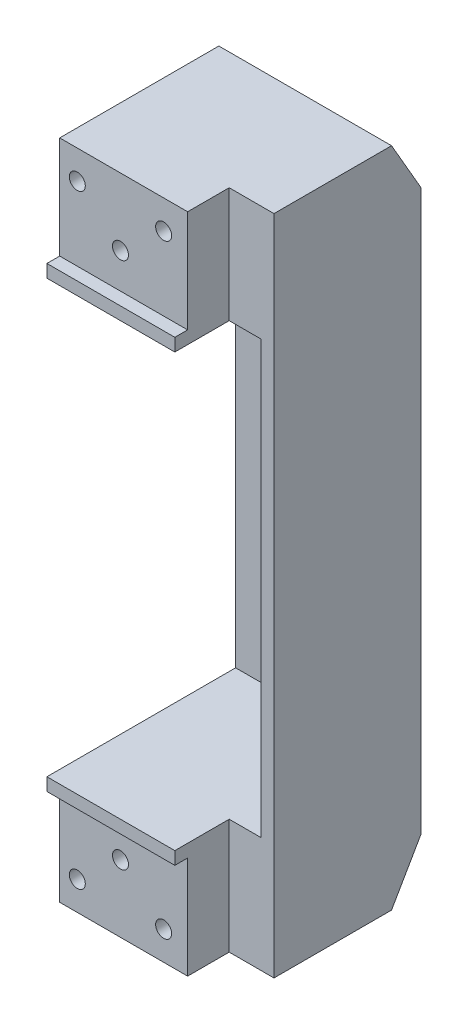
ISO-10303-21;
HEADER;
FILE_DESCRIPTION(('STEP AP214'),'2;1');
FILE_NAME('part.step','',(''),(''),'','','');
FILE_SCHEMA(('AUTOMOTIVE_DESIGN { 1 0 10303 214 1 1 1 1 }'));
ENDSEC;
DATA;
#1=APPLICATION_CONTEXT('core data for automotive mechanical design processes');
#2=APPLICATION_PROTOCOL_DEFINITION('international standard','automotive_design',2000,#1);
#3=PRODUCT_CONTEXT('',#1,'mechanical');
#4=PRODUCT('Part','Part','',(#3));
#5=PRODUCT_RELATED_PRODUCT_CATEGORY('part','',(#4));
#6=PRODUCT_DEFINITION_FORMATION('','',#4);
#7=PRODUCT_DEFINITION_CONTEXT('part definition',#1,'design');
#8=PRODUCT_DEFINITION('design','',#6,#7);
#9=PRODUCT_DEFINITION_SHAPE('','',#8);
#10=(LENGTH_UNIT() NAMED_UNIT(*) SI_UNIT(.MILLI.,.METRE.));
#11=(NAMED_UNIT(*) PLANE_ANGLE_UNIT() SI_UNIT($,.RADIAN.));
#12=(NAMED_UNIT(*) SI_UNIT($,.STERADIAN.) SOLID_ANGLE_UNIT());
#13=UNCERTAINTY_MEASURE_WITH_UNIT(LENGTH_MEASURE(1.E-05),#10,'distance_accuracy_value','');
#14=(GEOMETRIC_REPRESENTATION_CONTEXT(3) GLOBAL_UNCERTAINTY_ASSIGNED_CONTEXT((#13)) GLOBAL_UNIT_ASSIGNED_CONTEXT((#10,
#11,#12)) REPRESENTATION_CONTEXT('',''));
#15=CARTESIAN_POINT('',(0.,0.,0.));
#16=DIRECTION('',(0.,0.,1.));
#17=DIRECTION('',(1.,0.,0.));
#18=AXIS2_PLACEMENT_3D('',#15,#16,#17);
#19=CARTESIAN_POINT('',(0.,-175.,0.));
#20=DIRECTION('',(0.,1.,0.));
#21=DIRECTION('',(0.,0.,-1.));
#22=AXIS2_PLACEMENT_3D('',#19,#20,#21);
#23=PLANE('',#22);
#24=DIRECTION('',(-1.,0.,0.));
#25=VECTOR('',#24,1.);
#26=CARTESIAN_POINT('',(0.,-175.,0.));
#27=LINE('',#26,#25);
#28=CARTESIAN_POINT('',(40.,-175.,0.));
#29=VERTEX_POINT('',#28);
#30=CARTESIAN_POINT('',(0.,-175.,0.));
#31=VERTEX_POINT('',#30);
#32=EDGE_CURVE('E210',#29,#31,#27,.T.);
#33=ORIENTED_EDGE('',*,*,#32,.F.);
#34=DIRECTION('',(0.,0.,1.));
#35=VECTOR('',#34,1.);
#36=CARTESIAN_POINT('',(40.,-175.,-13.));
#37=LINE('',#36,#35);
#38=CARTESIAN_POINT('',(40.,-175.,4.));
#39=VERTEX_POINT('',#38);
#40=EDGE_CURVE('E236',#29,#39,#37,.T.);
#41=ORIENTED_EDGE('',*,*,#40,.T.);
#42=DIRECTION('',(-1.,0.,0.));
#43=VECTOR('',#42,1.);
#44=CARTESIAN_POINT('',(40.,-175.,4.));
#45=LINE('',#44,#43);
#46=CARTESIAN_POINT('',(0.,-175.,4.));
#47=VERTEX_POINT('',#46);
#48=EDGE_CURVE('E246',#39,#47,#45,.T.);
#49=ORIENTED_EDGE('',*,*,#48,.T.);
#50=DIRECTION('',(0.,0.,-1.));
#51=VECTOR('',#50,1.);
#52=CARTESIAN_POINT('',(0.,-175.,4.));
#53=LINE('',#52,#51);
#54=EDGE_CURVE('E231',#47,#31,#53,.T.);
#55=ORIENTED_EDGE('',*,*,#54,.T.);
#56=EDGE_LOOP('',(#33,#41,#49,#55));
#57=FACE_BOUND('',#56,.T.);
#58=ADVANCED_FACE('F42',(#57),#23,.F.);
#59=CARTESIAN_POINT('',(54.,-32.,-13.));
#60=DIRECTION('',(1.,0.,0.));
#61=DIRECTION('',(0.,0.,-1.));
#62=AXIS2_PLACEMENT_3D('',#59,#60,#61);
#63=PLANE('',#62);
#64=DIRECTION('',(0.,0.,1.));
#65=VECTOR('',#64,1.);
#66=CARTESIAN_POINT('',(54.,-207.,-59.));
#67=LINE('',#66,#65);
#68=CARTESIAN_POINT('',(54.,-207.,-49.762395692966));
#69=VERTEX_POINT('',#68);
#70=CARTESIAN_POINT('',(54.,-207.,-13.));
#71=VERTEX_POINT('',#70);
#72=EDGE_CURVE('E214',#69,#71,#67,.T.);
#73=ORIENTED_EDGE('',*,*,#72,.F.);
#74=DIRECTION('',(0.,-0.86602540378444,0.499999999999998));
#75=VECTOR('',#74,1.);
#76=CARTESIAN_POINT('',(54.,-91.6685842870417,-116.349019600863));
#77=LINE('',#76,#75);
#78=CARTESIAN_POINT('',(54.,-191.,-59.));
#79=VERTEX_POINT('',#78);
#80=EDGE_CURVE('E352',#69,#79,#77,.F.);
#81=ORIENTED_EDGE('',*,*,#80,.T.);
#82=DIRECTION('',(0.,1.,0.));
#83=VECTOR('',#82,1.);
#84=CARTESIAN_POINT('',(54.,-32.,-59.));
#85=LINE('',#84,#83);
#86=CARTESIAN_POINT('',(54.,-16.0000000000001,-59.));
#87=VERTEX_POINT('',#86);
#88=EDGE_CURVE('E320',#79,#87,#85,.T.);
#89=ORIENTED_EDGE('',*,*,#88,.T.);
#90=DIRECTION('',(0.,0.86602540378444,0.499999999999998));
#91=VECTOR('',#90,1.);
#92=CARTESIAN_POINT('',(54.,-8.08141571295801,-54.4282032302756));
#93=LINE('',#92,#91);
#94=CARTESIAN_POINT('',(54.,0.,-49.762395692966));
#95=VERTEX_POINT('',#94);
#96=EDGE_CURVE('E350',#87,#95,#93,.T.);
#97=ORIENTED_EDGE('',*,*,#96,.T.);
#98=DIRECTION('',(0.,0.,-1.));
#99=VECTOR('',#98,1.);
#100=CARTESIAN_POINT('',(54.,0.,-13.));
#101=LINE('',#100,#99);
#102=CARTESIAN_POINT('',(54.,0.,-13.));
#103=VERTEX_POINT('',#102);
#104=EDGE_CURVE('E316',#103,#95,#101,.T.);
#105=ORIENTED_EDGE('',*,*,#104,.F.);
#106=DIRECTION('',(0.,1.,0.));
#107=VECTOR('',#106,1.);
#108=CARTESIAN_POINT('',(54.,-32.,-13.));
#109=LINE('',#108,#107);
#110=EDGE_CURVE('E334',#71,#103,#109,.T.);
#111=ORIENTED_EDGE('',*,*,#110,.F.);
#112=EDGE_LOOP('',(#73,#81,#89,#97,#105,#111));
#113=FACE_BOUND('',#112,.T.);
#114=ADVANCED_FACE('F372',(#113),#63,.T.);
#115=CARTESIAN_POINT('',(54.,-32.,-13.));
#116=DIRECTION('',(0.,0.,1.));
#117=DIRECTION('',(1.,0.,0.));
#118=AXIS2_PLACEMENT_3D('',#115,#116,#117);
#119=PLANE('',#118);
#120=DIRECTION('',(1.,0.,0.));
#121=VECTOR('',#120,1.);
#122=CARTESIAN_POINT('',(54.,0.,-13.));
#123=LINE('',#122,#121);
#124=CARTESIAN_POINT('',(40.,0.,-13.));
#125=VERTEX_POINT('',#124);
#126=EDGE_CURVE('E321',#125,#103,#123,.T.);
#127=ORIENTED_EDGE('',*,*,#126,.F.);
#128=DIRECTION('',(0.,1.,0.));
#129=VECTOR('',#128,1.);
#130=CARTESIAN_POINT('',(40.,-32.,-13.));
#131=LINE('',#130,#129);
#132=CARTESIAN_POINT('',(40.,-36.,-13.));
#133=VERTEX_POINT('',#132);
#134=EDGE_CURVE('E337',#133,#125,#131,.T.);
#135=ORIENTED_EDGE('',*,*,#134,.F.);
#136=DIRECTION('',(-1.,0.,0.));
#137=VECTOR('',#136,1.);
#138=CARTESIAN_POINT('',(54.,-36.,-13.));
#139=LINE('',#138,#137);
#140=CARTESIAN_POINT('',(50.,-36.,-13.));
#141=VERTEX_POINT('',#140);
#142=EDGE_CURVE('E296',#141,#133,#139,.T.);
#143=ORIENTED_EDGE('',*,*,#142,.F.);
#144=DIRECTION('',(0.,1.,0.));
#145=VECTOR('',#144,1.);
#146=CARTESIAN_POINT('',(50.,-171.,-13.));
#147=LINE('',#146,#145);
#148=CARTESIAN_POINT('',(50.,-171.,-13.));
#149=VERTEX_POINT('',#148);
#150=EDGE_CURVE('E292',#149,#141,#147,.T.);
#151=ORIENTED_EDGE('',*,*,#150,.F.);
#152=DIRECTION('',(-1.,0.,0.));
#153=VECTOR('',#152,1.);
#154=CARTESIAN_POINT('',(54.,-171.,-13.));
#155=LINE('',#154,#153);
#156=CARTESIAN_POINT('',(40.,-171.,-13.));
#157=VERTEX_POINT('',#156);
#158=EDGE_CURVE('E242',#149,#157,#155,.T.);
#159=ORIENTED_EDGE('',*,*,#158,.T.);
#160=DIRECTION('',(0.,-1.,0.));
#161=VECTOR('',#160,1.);
#162=CARTESIAN_POINT('',(40.,-171.,-13.));
#163=LINE('',#162,#161);
#164=CARTESIAN_POINT('',(40.,-207.,-13.));
#165=VERTEX_POINT('',#164);
#166=EDGE_CURVE('E244',#157,#165,#163,.T.);
#167=ORIENTED_EDGE('',*,*,#166,.T.);
#168=DIRECTION('',(-1.,0.,0.));
#169=VECTOR('',#168,1.);
#170=CARTESIAN_POINT('',(54.,-207.,-13.));
#171=LINE('',#170,#169);
#172=EDGE_CURVE('E216',#71,#165,#171,.T.);
#173=ORIENTED_EDGE('',*,*,#172,.F.);
#174=ORIENTED_EDGE('',*,*,#110,.T.);
#175=EDGE_LOOP('',(#127,#135,#143,#151,#159,#167,#173,#174));
#176=FACE_BOUND('',#175,.T.);
#177=ADVANCED_FACE('F384',(#176),#119,.T.);
#178=CARTESIAN_POINT('',(40.,-32.,-13.));
#179=DIRECTION('',(1.,0.,0.));
#180=DIRECTION('',(0.,0.,-1.));
#181=AXIS2_PLACEMENT_3D('',#178,#179,#180);
#182=PLANE('',#181);
#183=DIRECTION('',(0.,0.,-1.));
#184=VECTOR('',#183,1.);
#185=CARTESIAN_POINT('',(40.,0.,-13.));
#186=LINE('',#185,#184);
#187=CARTESIAN_POINT('',(40.,0.,0.));
#188=VERTEX_POINT('',#187);
#189=EDGE_CURVE('E329',#188,#125,#186,.T.);
#190=ORIENTED_EDGE('',*,*,#189,.F.);
#191=DIRECTION('',(0.,1.,0.));
#192=VECTOR('',#191,1.);
#193=CARTESIAN_POINT('',(40.,-32.,0.));
#194=LINE('',#193,#192);
#195=CARTESIAN_POINT('',(40.,-32.,0.));
#196=VERTEX_POINT('',#195);
#197=EDGE_CURVE('E339',#196,#188,#194,.T.);
#198=ORIENTED_EDGE('',*,*,#197,.F.);
#199=DIRECTION('',(0.,0.,1.));
#200=VECTOR('',#199,1.);
#201=CARTESIAN_POINT('',(40.,-32.,-13.));
#202=LINE('',#201,#200);
#203=CARTESIAN_POINT('',(40.,-32.,4.));
#204=VERTEX_POINT('',#203);
#205=EDGE_CURVE('E295',#196,#204,#202,.T.);
#206=ORIENTED_EDGE('',*,*,#205,.T.);
#207=DIRECTION('',(0.,1.,0.));
#208=VECTOR('',#207,1.);
#209=CARTESIAN_POINT('',(40.,-36.,4.));
#210=LINE('',#209,#208);
#211=CARTESIAN_POINT('',(40.,-36.,4.));
#212=VERTEX_POINT('',#211);
#213=EDGE_CURVE('E313',#212,#204,#210,.T.);
#214=ORIENTED_EDGE('',*,*,#213,.F.);
#215=DIRECTION('',(0.,0.,1.));
#216=VECTOR('',#215,1.);
#217=CARTESIAN_POINT('',(40.,-36.,-13.));
#218=LINE('',#217,#216);
#219=EDGE_CURVE('E298',#133,#212,#218,.T.);
#220=ORIENTED_EDGE('',*,*,#219,.F.);
#221=ORIENTED_EDGE('',*,*,#134,.T.);
#222=EDGE_LOOP('',(#190,#198,#206,#214,#220,#221));
#223=FACE_BOUND('',#222,.T.);
#224=ADVANCED_FACE('F420',(#223),#182,.T.);
#225=CARTESIAN_POINT('',(0.,-32.,0.));
#226=DIRECTION('',(0.,0.,1.));
#227=DIRECTION('',(1.,0.,0.));
#228=AXIS2_PLACEMENT_3D('',#225,#226,#227);
#229=PLANE('',#228);
#230=CARTESIAN_POINT('',(5.5,-9.,0.));
#231=DIRECTION('',(0.,0.,1.));
#232=DIRECTION('',(1.,0.,0.));
#233=AXIS2_PLACEMENT_3D('',#230,#231,#232);
#234=CIRCLE('',#233,2.5);
#235=CARTESIAN_POINT('',(8.,-9.,0.));
#236=VERTEX_POINT('',#235);
#237=EDGE_CURVE('E256',#236,#236,#234,.T.);
#238=ORIENTED_EDGE('',*,*,#237,.F.);
#239=EDGE_LOOP('',(#238));
#240=FACE_BOUND('',#239,.T.);
#241=CARTESIAN_POINT('',(32.5,-9.,0.));
#242=DIRECTION('',(0.,0.,1.));
#243=DIRECTION('',(1.,0.,0.));
#244=AXIS2_PLACEMENT_3D('',#241,#242,#243);
#245=CIRCLE('',#244,2.5);
#246=CARTESIAN_POINT('',(35.,-9.,0.));
#247=VERTEX_POINT('',#246);
#248=EDGE_CURVE('E262',#247,#247,#245,.T.);
#249=ORIENTED_EDGE('',*,*,#248,.F.);
#250=EDGE_LOOP('',(#249));
#251=FACE_BOUND('',#250,.T.);
#252=CARTESIAN_POINT('',(19.,-21.,0.));
#253=DIRECTION('',(0.,0.,1.));
#254=DIRECTION('',(1.,0.,0.));
#255=AXIS2_PLACEMENT_3D('',#252,#253,#254);
#256=CIRCLE('',#255,2.5);
#257=CARTESIAN_POINT('',(21.5,-21.,0.));
#258=VERTEX_POINT('',#257);
#259=EDGE_CURVE('E268',#258,#258,#256,.T.);
#260=ORIENTED_EDGE('',*,*,#259,.F.);
#261=EDGE_LOOP('',(#260));
#262=FACE_BOUND('',#261,.T.);
#263=DIRECTION('',(1.,0.,0.));
#264=VECTOR('',#263,1.);
#265=CARTESIAN_POINT('',(0.,0.,0.));
#266=LINE('',#265,#264);
#267=CARTESIAN_POINT('',(0.,0.,0.));
#268=VERTEX_POINT('',#267);
#269=EDGE_CURVE('E326',#268,#188,#266,.T.);
#270=ORIENTED_EDGE('',*,*,#269,.F.);
#271=DIRECTION('',(0.,1.,0.));
#272=VECTOR('',#271,1.);
#273=CARTESIAN_POINT('',(0.,-32.,0.));
#274=LINE('',#273,#272);
#275=CARTESIAN_POINT('',(0.,-32.,0.));
#276=VERTEX_POINT('',#275);
#277=EDGE_CURVE('E341',#276,#268,#274,.T.);
#278=ORIENTED_EDGE('',*,*,#277,.F.);
#279=DIRECTION('',(1.,0.,0.));
#280=VECTOR('',#279,1.);
#281=CARTESIAN_POINT('',(0.,-32.,0.));
#282=LINE('',#281,#280);
#283=EDGE_CURVE('E317',#276,#196,#282,.T.);
#284=ORIENTED_EDGE('',*,*,#283,.T.);
#285=ORIENTED_EDGE('',*,*,#197,.T.);
#286=EDGE_LOOP('',(#270,#278,#284,#285));
#287=FACE_BOUND('',#286,.T.);
#288=ADVANCED_FACE('F431',(#240,#251,#262,#287),#229,.T.);
#289=CARTESIAN_POINT('',(0.,-32.,0.));
#290=DIRECTION('',(-1.,0.,0.));
#291=DIRECTION('',(0.,0.,1.));
#292=AXIS2_PLACEMENT_3D('',#289,#290,#291);
#293=PLANE('',#292);
#294=DIRECTION('',(0.,1.,0.));
#295=VECTOR('',#294,1.);
#296=CARTESIAN_POINT('',(0.,-32.,-59.));
#297=LINE('',#296,#295);
#298=CARTESIAN_POINT('',(0.,-191.,-59.));
#299=VERTEX_POINT('',#298);
#300=CARTESIAN_POINT('',(0.,-16.0000000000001,-59.));
#301=VERTEX_POINT('',#300);
#302=EDGE_CURVE('E344',#299,#301,#297,.T.);
#303=ORIENTED_EDGE('',*,*,#302,.F.);
#304=DIRECTION('',(0.,0.86602540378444,-0.499999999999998));
#305=VECTOR('',#304,1.);
#306=CARTESIAN_POINT('',(0.,-97.2977494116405,-113.099019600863));
#307=LINE('',#306,#305);
#308=CARTESIAN_POINT('',(0.,-207.,-49.762395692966));
#309=VERTEX_POINT('',#308);
#310=EDGE_CURVE('E50',#299,#309,#307,.F.);
#311=ORIENTED_EDGE('',*,*,#310,.T.);
#312=DIRECTION('',(0.,0.,-1.));
#313=VECTOR('',#312,1.);
#314=CARTESIAN_POINT('',(0.,-207.,0.));
#315=LINE('',#314,#313);
#316=CARTESIAN_POINT('',(0.,-207.,0.));
#317=VERTEX_POINT('',#316);
#318=EDGE_CURVE('E211',#317,#309,#315,.T.);
#319=ORIENTED_EDGE('',*,*,#318,.F.);
#320=DIRECTION('',(0.,1.,0.));
#321=VECTOR('',#320,1.);
#322=CARTESIAN_POINT('',(0.,-207.,0.));
#323=LINE('',#322,#321);
#324=EDGE_CURVE('E223',#317,#31,#323,.T.);
#325=ORIENTED_EDGE('',*,*,#324,.T.);
#326=ORIENTED_EDGE('',*,*,#54,.F.);
#327=DIRECTION('',(0.,-1.,0.));
#328=VECTOR('',#327,1.);
#329=CARTESIAN_POINT('',(0.,-171.,4.));
#330=LINE('',#329,#328);
#331=CARTESIAN_POINT('',(0.,-171.,4.));
#332=VERTEX_POINT('',#331);
#333=EDGE_CURVE('E254',#332,#47,#330,.T.);
#334=ORIENTED_EDGE('',*,*,#333,.F.);
#335=DIRECTION('',(0.,0.,-1.));
#336=VECTOR('',#335,1.);
#337=CARTESIAN_POINT('',(0.,-171.,4.));
#338=LINE('',#337,#336);
#339=CARTESIAN_POINT('',(0.,-171.,-55.));
#340=VERTEX_POINT('',#339);
#341=EDGE_CURVE('E232',#332,#340,#338,.T.);
#342=ORIENTED_EDGE('',*,*,#341,.T.);
#343=DIRECTION('',(0.,1.,0.));
#344=VECTOR('',#343,1.);
#345=CARTESIAN_POINT('',(0.,-171.,-55.));
#346=LINE('',#345,#344);
#347=CARTESIAN_POINT('',(0.,-36.,-55.));
#348=VERTEX_POINT('',#347);
#349=EDGE_CURVE('E282',#340,#348,#346,.T.);
#350=ORIENTED_EDGE('',*,*,#349,.T.);
#351=DIRECTION('',(0.,0.,-1.));
#352=VECTOR('',#351,1.);
#353=CARTESIAN_POINT('',(0.,-36.,4.));
#354=LINE('',#353,#352);
#355=CARTESIAN_POINT('',(0.,-36.,4.));
#356=VERTEX_POINT('',#355);
#357=EDGE_CURVE('E303',#356,#348,#354,.T.);
#358=ORIENTED_EDGE('',*,*,#357,.F.);
#359=DIRECTION('',(0.,1.,0.));
#360=VECTOR('',#359,1.);
#361=CARTESIAN_POINT('',(0.,-36.,4.));
#362=LINE('',#361,#360);
#363=CARTESIAN_POINT('',(0.,-32.,4.));
#364=VERTEX_POINT('',#363);
#365=EDGE_CURVE('E305',#356,#364,#362,.T.);
#366=ORIENTED_EDGE('',*,*,#365,.T.);
#367=DIRECTION('',(0.,0.,-1.));
#368=VECTOR('',#367,1.);
#369=CARTESIAN_POINT('',(0.,-32.,4.));
#370=LINE('',#369,#368);
#371=EDGE_CURVE('E299',#364,#276,#370,.T.);
#372=ORIENTED_EDGE('',*,*,#371,.T.);
#373=ORIENTED_EDGE('',*,*,#277,.T.);
#374=DIRECTION('',(0.,0.,1.));
#375=VECTOR('',#374,1.);
#376=CARTESIAN_POINT('',(0.,0.,0.));
#377=LINE('',#376,#375);
#378=CARTESIAN_POINT('',(0.,0.,-49.762395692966));
#379=VERTEX_POINT('',#378);
#380=EDGE_CURVE('E324',#379,#268,#377,.T.);
#381=ORIENTED_EDGE('',*,*,#380,.F.);
#382=DIRECTION('',(0.,-0.86602540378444,-0.499999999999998));
#383=VECTOR('',#382,1.);
#384=CARTESIAN_POINT('',(0.,-2.45225058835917,-51.1782032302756));
#385=LINE('',#384,#383);
#386=EDGE_CURVE('E57',#379,#301,#385,.T.);
#387=ORIENTED_EDGE('',*,*,#386,.T.);
#388=EDGE_LOOP('',(#303,#311,#319,#325,#326,#334,#342,#350,#358,#366,#372,#373,#381,#387));
#389=FACE_BOUND('',#388,.T.);
#390=ADVANCED_FACE('F360',(#389),#293,.T.);
#391=CARTESIAN_POINT('',(0.,-32.,-59.));
#392=DIRECTION('',(0.,0.,-1.));
#393=DIRECTION('',(-1.,0.,0.));
#394=AXIS2_PLACEMENT_3D('',#391,#392,#393);
#395=PLANE('',#394);
#396=ORIENTED_EDGE('',*,*,#88,.F.);
#397=DIRECTION('',(-1.,0.,0.));
#398=VECTOR('',#397,1.);
#399=CARTESIAN_POINT('',(0.,-191.,-59.));
#400=LINE('',#399,#398);
#401=EDGE_CURVE('E356',#79,#299,#400,.T.);
#402=ORIENTED_EDGE('',*,*,#401,.T.);
#403=ORIENTED_EDGE('',*,*,#302,.T.);
#404=DIRECTION('',(1.,0.,0.));
#405=VECTOR('',#404,1.);
#406=CARTESIAN_POINT('',(54.,-16.0000000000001,-59.));
#407=LINE('',#406,#405);
#408=EDGE_CURVE('E354',#301,#87,#407,.T.);
#409=ORIENTED_EDGE('',*,*,#408,.T.);
#410=EDGE_LOOP('',(#396,#402,#403,#409));
#411=FACE_BOUND('',#410,.T.);
#412=ADVANCED_FACE('F376',(#411),#395,.T.);
#413=CARTESIAN_POINT('',(0.,0.,0.));
#414=DIRECTION('',(0.,-1.,0.));
#415=DIRECTION('',(0.,0.,-1.));
#416=AXIS2_PLACEMENT_3D('',#413,#414,#415);
#417=PLANE('',#416);
#418=ORIENTED_EDGE('',*,*,#104,.T.);
#419=DIRECTION('',(-1.,0.,0.));
#420=VECTOR('',#419,1.);
#421=CARTESIAN_POINT('',(0.,0.,-49.762395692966));
#422=LINE('',#421,#420);
#423=EDGE_CURVE('E11',#95,#379,#422,.T.);
#424=ORIENTED_EDGE('',*,*,#423,.T.);
#425=ORIENTED_EDGE('',*,*,#380,.T.);
#426=ORIENTED_EDGE('',*,*,#269,.T.);
#427=ORIENTED_EDGE('',*,*,#189,.T.);
#428=ORIENTED_EDGE('',*,*,#126,.T.);
#429=EDGE_LOOP('',(#418,#424,#425,#426,#427,#428));
#430=FACE_BOUND('',#429,.T.);
#431=ADVANCED_FACE('F379',(#430),#417,.F.);
#432=CARTESIAN_POINT('',(40.,-36.,4.));
#433=DIRECTION('',(0.,0.,-1.));
#434=DIRECTION('',(-1.,0.,0.));
#435=AXIS2_PLACEMENT_3D('',#432,#433,#434);
#436=PLANE('',#435);
#437=DIRECTION('',(-1.,0.,0.));
#438=VECTOR('',#437,1.);
#439=CARTESIAN_POINT('',(40.,-32.,4.));
#440=LINE('',#439,#438);
#441=EDGE_CURVE('E307',#204,#364,#440,.T.);
#442=ORIENTED_EDGE('',*,*,#441,.T.);
#443=ORIENTED_EDGE('',*,*,#365,.F.);
#444=DIRECTION('',(-1.,0.,0.));
#445=VECTOR('',#444,1.);
#446=CARTESIAN_POINT('',(40.,-36.,4.));
#447=LINE('',#446,#445);
#448=EDGE_CURVE('E301',#212,#356,#447,.T.);
#449=ORIENTED_EDGE('',*,*,#448,.F.);
#450=ORIENTED_EDGE('',*,*,#213,.T.);
#451=EDGE_LOOP('',(#442,#443,#449,#450));
#452=FACE_BOUND('',#451,.T.);
#453=ADVANCED_FACE('F424',(#452),#436,.F.);
#454=CARTESIAN_POINT('',(0.,-36.,0.));
#455=DIRECTION('',(0.,-1.,0.));
#456=DIRECTION('',(0.,0.,-1.));
#457=AXIS2_PLACEMENT_3D('',#454,#455,#456);
#458=PLANE('',#457);
#459=DIRECTION('',(-1.,0.,0.));
#460=VECTOR('',#459,1.);
#461=CARTESIAN_POINT('',(0.,-36.,-55.));
#462=LINE('',#461,#460);
#463=CARTESIAN_POINT('',(50.,-36.,-55.));
#464=VERTEX_POINT('',#463);
#465=EDGE_CURVE('E279',#464,#348,#462,.T.);
#466=ORIENTED_EDGE('',*,*,#465,.F.);
#467=DIRECTION('',(0.,0.,-1.));
#468=VECTOR('',#467,1.);
#469=CARTESIAN_POINT('',(50.,-36.,-13.));
#470=LINE('',#469,#468);
#471=EDGE_CURVE('E274',#141,#464,#470,.T.);
#472=ORIENTED_EDGE('',*,*,#471,.F.);
#473=ORIENTED_EDGE('',*,*,#142,.T.);
#474=ORIENTED_EDGE('',*,*,#219,.T.);
#475=ORIENTED_EDGE('',*,*,#448,.T.);
#476=ORIENTED_EDGE('',*,*,#357,.T.);
#477=EDGE_LOOP('',(#466,#472,#473,#474,#475,#476));
#478=FACE_BOUND('',#477,.T.);
#479=ADVANCED_FACE('F412',(#478),#458,.T.);
#480=CARTESIAN_POINT('',(0.,-32.,0.));
#481=DIRECTION('',(0.,-1.,0.));
#482=DIRECTION('',(0.,0.,-1.));
#483=AXIS2_PLACEMENT_3D('',#480,#481,#482);
#484=PLANE('',#483);
#485=ORIENTED_EDGE('',*,*,#283,.F.);
#486=ORIENTED_EDGE('',*,*,#371,.F.);
#487=ORIENTED_EDGE('',*,*,#441,.F.);
#488=ORIENTED_EDGE('',*,*,#205,.F.);
#489=EDGE_LOOP('',(#485,#486,#487,#488));
#490=FACE_BOUND('',#489,.T.);
#491=ADVANCED_FACE('F428',(#490),#484,.F.);
#492=CARTESIAN_POINT('',(50.,-171.,-13.));
#493=DIRECTION('',(1.,0.,0.));
#494=DIRECTION('',(0.,0.,-1.));
#495=AXIS2_PLACEMENT_3D('',#492,#493,#494);
#496=PLANE('',#495);
#497=ORIENTED_EDGE('',*,*,#471,.T.);
#498=DIRECTION('',(0.,1.,0.));
#499=VECTOR('',#498,1.);
#500=CARTESIAN_POINT('',(50.,-171.,-55.));
#501=LINE('',#500,#499);
#502=CARTESIAN_POINT('',(50.,-171.,-55.));
#503=VERTEX_POINT('',#502);
#504=EDGE_CURVE('E289',#503,#464,#501,.T.);
#505=ORIENTED_EDGE('',*,*,#504,.F.);
#506=DIRECTION('',(0.,0.,-1.));
#507=VECTOR('',#506,1.);
#508=CARTESIAN_POINT('',(50.,-171.,-13.));
#509=LINE('',#508,#507);
#510=EDGE_CURVE('E275',#149,#503,#509,.T.);
#511=ORIENTED_EDGE('',*,*,#510,.F.);
#512=ORIENTED_EDGE('',*,*,#150,.T.);
#513=EDGE_LOOP('',(#497,#505,#511,#512));
#514=FACE_BOUND('',#513,.T.);
#515=ADVANCED_FACE('F414',(#514),#496,.F.);
#516=CARTESIAN_POINT('',(0.,-171.,-55.));
#517=DIRECTION('',(0.,0.,-1.));
#518=DIRECTION('',(-1.,0.,0.));
#519=AXIS2_PLACEMENT_3D('',#516,#517,#518);
#520=PLANE('',#519);
#521=ORIENTED_EDGE('',*,*,#465,.T.);
#522=ORIENTED_EDGE('',*,*,#349,.F.);
#523=DIRECTION('',(-1.,0.,0.));
#524=VECTOR('',#523,1.);
#525=CARTESIAN_POINT('',(0.,-171.,-55.));
#526=LINE('',#525,#524);
#527=EDGE_CURVE('E278',#503,#340,#526,.T.);
#528=ORIENTED_EDGE('',*,*,#527,.F.);
#529=ORIENTED_EDGE('',*,*,#504,.T.);
#530=EDGE_LOOP('',(#521,#522,#528,#529));
#531=FACE_BOUND('',#530,.T.);
#532=ADVANCED_FACE('F410',(#531),#520,.F.);
#533=CARTESIAN_POINT('',(19.,-21.,-18.));
#534=DIRECTION('',(0.,0.,1.));
#535=DIRECTION('',(1.,0.,0.));
#536=AXIS2_PLACEMENT_3D('',#533,#534,#535);
#537=CONICAL_SURFACE('',#536,2.5,1.02974425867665);
#538=CARTESIAN_POINT('',(19.,-21.,-19.5021515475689));
#539=VERTEX_POINT('',#538);
#540=VERTEX_LOOP('',#539);
#541=FACE_BOUND('',#540,.T.);
#542=CARTESIAN_POINT('',(19.,-21.,-18.));
#543=DIRECTION('',(0.,0.,1.));
#544=DIRECTION('',(1.,0.,0.));
#545=AXIS2_PLACEMENT_3D('',#542,#543,#544);
#546=CIRCLE('',#545,2.5);
#547=CARTESIAN_POINT('',(21.5,-21.,-18.));
#548=VERTEX_POINT('',#547);
#549=EDGE_CURVE('E271',#548,#548,#546,.T.);
#550=ORIENTED_EDGE('',*,*,#549,.T.);
#551=EDGE_LOOP('',(#550));
#552=FACE_BOUND('',#551,.T.);
#553=ADVANCED_FACE('F475',(#541,#552),#537,.F.);
#554=CARTESIAN_POINT('',(19.,-21.,0.));
#555=DIRECTION('',(0.,0.,1.));
#556=DIRECTION('',(1.,0.,0.));
#557=AXIS2_PLACEMENT_3D('',#554,#555,#556);
#558=CYLINDRICAL_SURFACE('',#557,2.5);
#559=ORIENTED_EDGE('',*,*,#549,.F.);
#560=EDGE_LOOP('',(#559));
#561=FACE_BOUND('',#560,.T.);
#562=ORIENTED_EDGE('',*,*,#259,.T.);
#563=EDGE_LOOP('',(#562));
#564=FACE_BOUND('',#563,.T.);
#565=ADVANCED_FACE('F471',(#561,#564),#558,.F.);
#566=CARTESIAN_POINT('',(32.5,-9.,-18.));
#567=DIRECTION('',(0.,0.,1.));
#568=DIRECTION('',(1.,0.,0.));
#569=AXIS2_PLACEMENT_3D('',#566,#567,#568);
#570=CONICAL_SURFACE('',#569,2.5,1.02974425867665);
#571=CARTESIAN_POINT('',(32.5,-9.,-19.5021515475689));
#572=VERTEX_POINT('',#571);
#573=VERTEX_LOOP('',#572);
#574=FACE_BOUND('',#573,.T.);
#575=CARTESIAN_POINT('',(32.5,-9.,-18.));
#576=DIRECTION('',(0.,0.,1.));
#577=DIRECTION('',(1.,0.,0.));
#578=AXIS2_PLACEMENT_3D('',#575,#576,#577);
#579=CIRCLE('',#578,2.5);
#580=CARTESIAN_POINT('',(35.,-9.,-18.));
#581=VERTEX_POINT('',#580);
#582=EDGE_CURVE('E265',#581,#581,#579,.T.);
#583=ORIENTED_EDGE('',*,*,#582,.T.);
#584=EDGE_LOOP('',(#583));
#585=FACE_BOUND('',#584,.T.);
#586=ADVANCED_FACE('F467',(#574,#585),#570,.F.);
#587=CARTESIAN_POINT('',(32.5,-9.,0.));
#588=DIRECTION('',(0.,0.,1.));
#589=DIRECTION('',(1.,0.,0.));
#590=AXIS2_PLACEMENT_3D('',#587,#588,#589);
#591=CYLINDRICAL_SURFACE('',#590,2.5);
#592=ORIENTED_EDGE('',*,*,#582,.F.);
#593=EDGE_LOOP('',(#592));
#594=FACE_BOUND('',#593,.T.);
#595=ORIENTED_EDGE('',*,*,#248,.T.);
#596=EDGE_LOOP('',(#595));
#597=FACE_BOUND('',#596,.T.);
#598=ADVANCED_FACE('F463',(#594,#597),#591,.F.);
#599=CARTESIAN_POINT('',(5.5,-9.,-18.));
#600=DIRECTION('',(0.,0.,1.));
#601=DIRECTION('',(1.,0.,0.));
#602=AXIS2_PLACEMENT_3D('',#599,#600,#601);
#603=CONICAL_SURFACE('',#602,2.5,1.02974425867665);
#604=CARTESIAN_POINT('',(5.49999999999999,-9.,-19.5021515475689));
#605=VERTEX_POINT('',#604);
#606=VERTEX_LOOP('',#605);
#607=FACE_BOUND('',#606,.T.);
#608=CARTESIAN_POINT('',(5.5,-9.,-18.));
#609=DIRECTION('',(0.,0.,1.));
#610=DIRECTION('',(1.,0.,0.));
#611=AXIS2_PLACEMENT_3D('',#608,#609,#610);
#612=CIRCLE('',#611,2.5);
#613=CARTESIAN_POINT('',(8.,-9.,-18.));
#614=VERTEX_POINT('',#613);
#615=EDGE_CURVE('E259',#614,#614,#612,.T.);
#616=ORIENTED_EDGE('',*,*,#615,.T.);
#617=EDGE_LOOP('',(#616));
#618=FACE_BOUND('',#617,.T.);
#619=ADVANCED_FACE('F459',(#607,#618),#603,.F.);
#620=CARTESIAN_POINT('',(5.5,-9.,0.));
#621=DIRECTION('',(0.,0.,1.));
#622=DIRECTION('',(1.,0.,0.));
#623=AXIS2_PLACEMENT_3D('',#620,#621,#622);
#624=CYLINDRICAL_SURFACE('',#623,2.5);
#625=ORIENTED_EDGE('',*,*,#615,.F.);
#626=EDGE_LOOP('',(#625));
#627=FACE_BOUND('',#626,.T.);
#628=ORIENTED_EDGE('',*,*,#237,.T.);
#629=EDGE_LOOP('',(#628));
#630=FACE_BOUND('',#629,.T.);
#631=ADVANCED_FACE('F456',(#627,#630),#624,.F.);
#632=CARTESIAN_POINT('',(40.,-171.,4.));
#633=DIRECTION('',(0.,0.,1.));
#634=DIRECTION('',(1.,0.,0.));
#635=AXIS2_PLACEMENT_3D('',#632,#633,#634);
#636=PLANE('',#635);
#637=ORIENTED_EDGE('',*,*,#48,.F.);
#638=DIRECTION('',(0.,-1.,0.));
#639=VECTOR('',#638,1.);
#640=CARTESIAN_POINT('',(40.,-171.,4.));
#641=LINE('',#640,#639);
#642=CARTESIAN_POINT('',(40.,-171.,4.));
#643=VERTEX_POINT('',#642);
#644=EDGE_CURVE('E251',#643,#39,#641,.T.);
#645=ORIENTED_EDGE('',*,*,#644,.F.);
#646=DIRECTION('',(-1.,0.,0.));
#647=VECTOR('',#646,1.);
#648=CARTESIAN_POINT('',(40.,-171.,4.));
#649=LINE('',#648,#647);
#650=EDGE_CURVE('E235',#643,#332,#649,.T.);
#651=ORIENTED_EDGE('',*,*,#650,.T.);
#652=ORIENTED_EDGE('',*,*,#333,.T.);
#653=EDGE_LOOP('',(#637,#645,#651,#652));
#654=FACE_BOUND('',#653,.T.);
#655=ADVANCED_FACE('F402',(#654),#636,.T.);
#656=CARTESIAN_POINT('',(40.,-171.,-13.));
#657=DIRECTION('',(1.,0.,0.));
#658=DIRECTION('',(0.,0.,-1.));
#659=AXIS2_PLACEMENT_3D('',#656,#657,#658);
#660=PLANE('',#659);
#661=ORIENTED_EDGE('',*,*,#40,.F.);
#662=DIRECTION('',(0.,1.,0.));
#663=VECTOR('',#662,1.);
#664=CARTESIAN_POINT('',(40.,-207.,0.));
#665=LINE('',#664,#663);
#666=CARTESIAN_POINT('',(40.,-207.,0.));
#667=VERTEX_POINT('',#666);
#668=EDGE_CURVE('E228',#667,#29,#665,.T.);
#669=ORIENTED_EDGE('',*,*,#668,.F.);
#670=DIRECTION('',(0.,0.,1.));
#671=VECTOR('',#670,1.);
#672=CARTESIAN_POINT('',(40.,-207.,-13.));
#673=LINE('',#672,#671);
#674=EDGE_CURVE('E219',#165,#667,#673,.T.);
#675=ORIENTED_EDGE('',*,*,#674,.F.);
#676=ORIENTED_EDGE('',*,*,#166,.F.);
#677=DIRECTION('',(0.,0.,1.));
#678=VECTOR('',#677,1.);
#679=CARTESIAN_POINT('',(40.,-171.,-13.));
#680=LINE('',#679,#678);
#681=EDGE_CURVE('E239',#157,#643,#680,.T.);
#682=ORIENTED_EDGE('',*,*,#681,.T.);
#683=ORIENTED_EDGE('',*,*,#644,.T.);
#684=EDGE_LOOP('',(#661,#669,#675,#676,#682,#683));
#685=FACE_BOUND('',#684,.T.);
#686=ADVANCED_FACE('F393',(#685),#660,.T.);
#687=CARTESIAN_POINT('',(0.,-171.,0.));
#688=DIRECTION('',(0.,1.,0.));
#689=DIRECTION('',(0.,0.,-1.));
#690=AXIS2_PLACEMENT_3D('',#687,#688,#689);
#691=PLANE('',#690);
#692=ORIENTED_EDGE('',*,*,#158,.F.);
#693=ORIENTED_EDGE('',*,*,#510,.T.);
#694=ORIENTED_EDGE('',*,*,#527,.T.);
#695=ORIENTED_EDGE('',*,*,#341,.F.);
#696=ORIENTED_EDGE('',*,*,#650,.F.);
#697=ORIENTED_EDGE('',*,*,#681,.F.);
#698=EDGE_LOOP('',(#692,#693,#694,#695,#696,#697));
#699=FACE_BOUND('',#698,.T.);
#700=ADVANCED_FACE('F406',(#699),#691,.T.);
#701=CARTESIAN_POINT('',(0.,-207.,0.));
#702=DIRECTION('',(0.,0.,-1.));
#703=DIRECTION('',(-1.,0.,0.));
#704=AXIS2_PLACEMENT_3D('',#701,#702,#703);
#705=PLANE('',#704);
#706=CARTESIAN_POINT('',(32.5,-198.,0.));
#707=DIRECTION('',(0.,0.,1.));
#708=DIRECTION('',(1.,0.,0.));
#709=AXIS2_PLACEMENT_3D('',#706,#707,#708);
#710=CIRCLE('',#709,2.49999999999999);
#711=CARTESIAN_POINT('',(35.,-198.,0.));
#712=VERTEX_POINT('',#711);
#713=EDGE_CURVE('E194',#712,#712,#710,.T.);
#714=ORIENTED_EDGE('',*,*,#713,.F.);
#715=EDGE_LOOP('',(#714));
#716=FACE_BOUND('',#715,.T.);
#717=CARTESIAN_POINT('',(5.5,-198.,0.));
#718=DIRECTION('',(0.,0.,1.));
#719=DIRECTION('',(1.,0.,0.));
#720=AXIS2_PLACEMENT_3D('',#717,#718,#719);
#721=CIRCLE('',#720,2.49999999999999);
#722=CARTESIAN_POINT('',(7.99999999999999,-198.,0.));
#723=VERTEX_POINT('',#722);
#724=EDGE_CURVE('E193',#723,#723,#721,.T.);
#725=ORIENTED_EDGE('',*,*,#724,.F.);
#726=EDGE_LOOP('',(#725));
#727=FACE_BOUND('',#726,.T.);
#728=CARTESIAN_POINT('',(19.,-186.,0.));
#729=DIRECTION('',(0.,0.,1.));
#730=DIRECTION('',(1.,0.,0.));
#731=AXIS2_PLACEMENT_3D('',#728,#729,#730);
#732=CIRCLE('',#731,2.49999999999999);
#733=CARTESIAN_POINT('',(21.5,-186.,0.));
#734=VERTEX_POINT('',#733);
#735=EDGE_CURVE('E204',#734,#734,#732,.T.);
#736=ORIENTED_EDGE('',*,*,#735,.F.);
#737=EDGE_LOOP('',(#736));
#738=FACE_BOUND('',#737,.T.);
#739=ORIENTED_EDGE('',*,*,#32,.T.);
#740=ORIENTED_EDGE('',*,*,#324,.F.);
#741=DIRECTION('',(-1.,0.,0.));
#742=VECTOR('',#741,1.);
#743=CARTESIAN_POINT('',(0.,-207.,0.));
#744=LINE('',#743,#742);
#745=EDGE_CURVE('E221',#667,#317,#744,.T.);
#746=ORIENTED_EDGE('',*,*,#745,.F.);
#747=ORIENTED_EDGE('',*,*,#668,.T.);
#748=EDGE_LOOP('',(#739,#740,#746,#747));
#749=FACE_BOUND('',#748,.T.);
#750=ADVANCED_FACE('F396',(#716,#727,#738,#749),#705,.F.);
#751=CARTESIAN_POINT('',(0.,-207.,0.));
#752=DIRECTION('',(0.,-1.,0.));
#753=DIRECTION('',(0.,0.,-1.));
#754=AXIS2_PLACEMENT_3D('',#751,#752,#753);
#755=PLANE('',#754);
#756=ORIENTED_EDGE('',*,*,#318,.T.);
#757=DIRECTION('',(1.,0.,0.));
#758=VECTOR('',#757,1.);
#759=CARTESIAN_POINT('',(0.,-207.,-49.762395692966));
#760=LINE('',#759,#758);
#761=EDGE_CURVE('E336',#309,#69,#760,.T.);
#762=ORIENTED_EDGE('',*,*,#761,.T.);
#763=ORIENTED_EDGE('',*,*,#72,.T.);
#764=ORIENTED_EDGE('',*,*,#172,.T.);
#765=ORIENTED_EDGE('',*,*,#674,.T.);
#766=ORIENTED_EDGE('',*,*,#745,.T.);
#767=EDGE_LOOP('',(#756,#762,#763,#764,#765,#766));
#768=FACE_BOUND('',#767,.T.);
#769=ADVANCED_FACE('F365',(#768),#755,.T.);
#770=CARTESIAN_POINT('',(0.,-207.,-49.762395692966));
#771=DIRECTION('',(0.,0.499999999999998,0.86602540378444));
#772=DIRECTION('',(1.,0.,0.));
#773=AXIS2_PLACEMENT_3D('',#770,#771,#772);
#774=PLANE('',#773);
#775=ORIENTED_EDGE('',*,*,#310,.F.);
#776=ORIENTED_EDGE('',*,*,#401,.F.);
#777=ORIENTED_EDGE('',*,*,#80,.F.);
#778=ORIENTED_EDGE('',*,*,#761,.F.);
#779=EDGE_LOOP('',(#775,#776,#777,#778));
#780=FACE_BOUND('',#779,.T.);
#781=ADVANCED_FACE('F369',(#780),#774,.F.);
#782=CARTESIAN_POINT('',(0.,0.,-49.762395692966));
#783=DIRECTION('',(0.,0.499999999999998,-0.86602540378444));
#784=DIRECTION('',(1.,0.,0.));
#785=AXIS2_PLACEMENT_3D('',#782,#783,#784);
#786=PLANE('',#785);
#787=ORIENTED_EDGE('',*,*,#96,.F.);
#788=ORIENTED_EDGE('',*,*,#408,.F.);
#789=ORIENTED_EDGE('',*,*,#386,.F.);
#790=ORIENTED_EDGE('',*,*,#423,.F.);
#791=EDGE_LOOP('',(#787,#788,#789,#790));
#792=FACE_BOUND('',#791,.T.);
#793=ADVANCED_FACE('F44',(#792),#786,.T.);
#794=CARTESIAN_POINT('',(19.,-186.,-20.));
#795=DIRECTION('',(0.,0.,1.));
#796=DIRECTION('',(1.,0.,0.));
#797=AXIS2_PLACEMENT_3D('',#794,#795,#796);
#798=CONICAL_SURFACE('',#797,2.5,1.02974425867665);
#799=CARTESIAN_POINT('',(19.,-186.,-21.5021515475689));
#800=VERTEX_POINT('',#799);
#801=VERTEX_LOOP('',#800);
#802=FACE_BOUND('',#801,.T.);
#803=CARTESIAN_POINT('',(19.,-186.,-20.));
#804=DIRECTION('',(0.,0.,1.));
#805=DIRECTION('',(1.,0.,0.));
#806=AXIS2_PLACEMENT_3D('',#803,#804,#805);
#807=CIRCLE('',#806,2.5);
#808=CARTESIAN_POINT('',(21.5,-186.,-20.));
#809=VERTEX_POINT('',#808);
#810=EDGE_CURVE('E207',#809,#809,#807,.T.);
#811=ORIENTED_EDGE('',*,*,#810,.T.);
#812=EDGE_LOOP('',(#811));
#813=FACE_BOUND('',#812,.T.);
#814=ADVANCED_FACE('F674',(#802,#813),#798,.F.);
#815=CARTESIAN_POINT('',(19.,-186.,0.));
#816=DIRECTION('',(0.,0.,1.));
#817=DIRECTION('',(1.,0.,0.));
#818=AXIS2_PLACEMENT_3D('',#815,#816,#817);
#819=CYLINDRICAL_SURFACE('',#818,2.49999999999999);
#820=ORIENTED_EDGE('',*,*,#810,.F.);
#821=EDGE_LOOP('',(#820));
#822=FACE_BOUND('',#821,.T.);
#823=ORIENTED_EDGE('',*,*,#735,.T.);
#824=EDGE_LOOP('',(#823));
#825=FACE_BOUND('',#824,.T.);
#826=ADVANCED_FACE('F680',(#822,#825),#819,.F.);
#827=CARTESIAN_POINT('',(5.5,-198.,-20.));
#828=DIRECTION('',(0.,0.,1.));
#829=DIRECTION('',(1.,0.,0.));
#830=AXIS2_PLACEMENT_3D('',#827,#828,#829);
#831=CONICAL_SURFACE('',#830,2.5,1.02974425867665);
#832=CARTESIAN_POINT('',(5.49999999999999,-198.,-21.5021515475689));
#833=VERTEX_POINT('',#832);
#834=VERTEX_LOOP('',#833);
#835=FACE_BOUND('',#834,.T.);
#836=CARTESIAN_POINT('',(5.5,-198.,-20.));
#837=DIRECTION('',(0.,0.,1.));
#838=DIRECTION('',(1.,0.,0.));
#839=AXIS2_PLACEMENT_3D('',#836,#837,#838);
#840=CIRCLE('',#839,2.5);
#841=CARTESIAN_POINT('',(7.99999999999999,-198.,-20.));
#842=VERTEX_POINT('',#841);
#843=EDGE_CURVE('E197',#842,#842,#840,.T.);
#844=ORIENTED_EDGE('',*,*,#843,.T.);
#845=EDGE_LOOP('',(#844));
#846=FACE_BOUND('',#845,.T.);
#847=ADVANCED_FACE('F689',(#835,#846),#831,.F.);
#848=CARTESIAN_POINT('',(5.5,-198.,0.));
#849=DIRECTION('',(0.,0.,1.));
#850=DIRECTION('',(1.,0.,0.));
#851=AXIS2_PLACEMENT_3D('',#848,#849,#850);
#852=CYLINDRICAL_SURFACE('',#851,2.49999999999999);
#853=ORIENTED_EDGE('',*,*,#843,.F.);
#854=EDGE_LOOP('',(#853));
#855=FACE_BOUND('',#854,.T.);
#856=ORIENTED_EDGE('',*,*,#724,.T.);
#857=EDGE_LOOP('',(#856));
#858=FACE_BOUND('',#857,.T.);
#859=ADVANCED_FACE('F187',(#855,#858),#852,.F.);
#860=CARTESIAN_POINT('',(32.5,-198.,-20.));
#861=DIRECTION('',(0.,0.,1.));
#862=DIRECTION('',(1.,0.,0.));
#863=AXIS2_PLACEMENT_3D('',#860,#861,#862);
#864=CONICAL_SURFACE('',#863,2.5,1.02974425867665);
#865=CARTESIAN_POINT('',(32.5,-198.,-21.5021515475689));
#866=VERTEX_POINT('',#865);
#867=VERTEX_LOOP('',#866);
#868=FACE_BOUND('',#867,.T.);
#869=CARTESIAN_POINT('',(32.5,-198.,-20.));
#870=DIRECTION('',(0.,0.,1.));
#871=DIRECTION('',(1.,0.,0.));
#872=AXIS2_PLACEMENT_3D('',#869,#870,#871);
#873=CIRCLE('',#872,2.5);
#874=CARTESIAN_POINT('',(35.,-198.,-20.));
#875=VERTEX_POINT('',#874);
#876=EDGE_CURVE('E191',#875,#875,#873,.T.);
#877=ORIENTED_EDGE('',*,*,#876,.T.);
#878=EDGE_LOOP('',(#877));
#879=FACE_BOUND('',#878,.T.);
#880=ADVANCED_FACE('F183',(#868,#879),#864,.F.);
#881=CARTESIAN_POINT('',(32.5,-198.,0.));
#882=DIRECTION('',(0.,0.,1.));
#883=DIRECTION('',(1.,0.,0.));
#884=AXIS2_PLACEMENT_3D('',#881,#882,#883);
#885=CYLINDRICAL_SURFACE('',#884,2.49999999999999);
#886=ORIENTED_EDGE('',*,*,#876,.F.);
#887=EDGE_LOOP('',(#886));
#888=FACE_BOUND('',#887,.T.);
#889=ORIENTED_EDGE('',*,*,#713,.T.);
#890=EDGE_LOOP('',(#889));
#891=FACE_BOUND('',#890,.T.);
#892=ADVANCED_FACE('F186',(#888,#891),#885,.F.);
#893=CLOSED_SHELL('',(#58,#114,#177,#224,#288,#390,#412,#431,#453,#479,#491,#515,#532,#553,#565,
#586,#598,#619,#631,#655,#686,#700,#750,#769,#781,#793,#814,#826,#847,#859,#880,#892));
#894=MANIFOLD_SOLID_BREP('B2',#893);
#895=ADVANCED_BREP_SHAPE_REPRESENTATION('',(#18,#894),#14);
#896=SHAPE_DEFINITION_REPRESENTATION(#9,#895);
ENDSEC;
END-ISO-10303-21;
